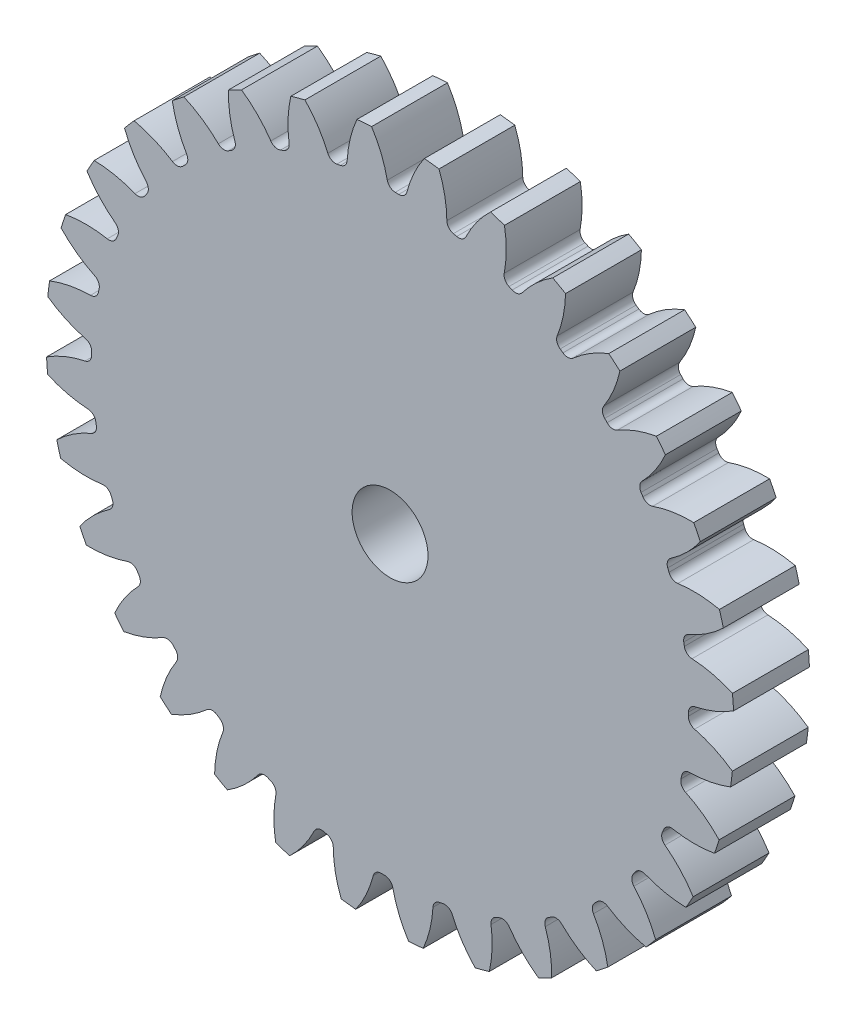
from build123d import *

# Parameters (mm, degrees)
SKETCH3_R         = 575.733333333
GEARBODY_DEPTH    = 127
TOOTHCUT_DEPTH    = 825.055060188
CIRPATTERN1_COUNT = 32
BOREDIA_R         = 63.5
BORE_DEPTH        = 12700


with BuildPart() as part:
    # Sketch3 → gearBody (new body)
    with BuildSketch(Plane.XY):
        Circle(SKETCH3_R)
    extrude(amount=GEARBODY_DEPTH)

    # Sketch2 → toothCut (cut, through all)
    with BuildSketch(Plane.XY):
        with BuildLine():
            ThreePointArc((499.324291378, -14.45002252), (499.399779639, -11.550376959), (499.458429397, -8.650341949))
            ThreePointArc((499.458429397, -8.650341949), (502.613858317, -0.109831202), (510.405729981, 4.600136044))
            ThreePointArc((510.405729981, 4.600136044), (544.298286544, 15.026180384), (575.733333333, 31.434886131))
            ThreePointArc((575.733333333, 31.434886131), (576.436707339, -13.332126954), (573.664403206, -58.018752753))
            ThreePointArc((573.664403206, -58.018752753), (543.021581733, -40.174277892), (509.647286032, -28.192450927))
            ThreePointArc((509.647286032, -28.192450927), (502.081498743, -23.127283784), (499.324291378, -14.45002252))
        make_face()
    toothcut = extrude(amount=TOOTHCUT_DEPTH, mode=Mode.SUBTRACT)

    # CirPattern1: toothCut ×32 about axis
    cirpattern1_axis = Axis((0, 0, 0), (0, 0, 1))
    for i in range(1, CIRPATTERN1_COUNT):
        add(toothcut.rotate(cirpattern1_axis, i * 360 / CIRPATTERN1_COUNT), mode=Mode.SUBTRACT)

    # boreDia → bore (cut, symmetric)
    with BuildSketch(Plane.XY):
        Circle(BOREDIA_R)
    extrude(amount=BORE_DEPTH, both=True, mode=Mode.SUBTRACT)


solid = part.part
